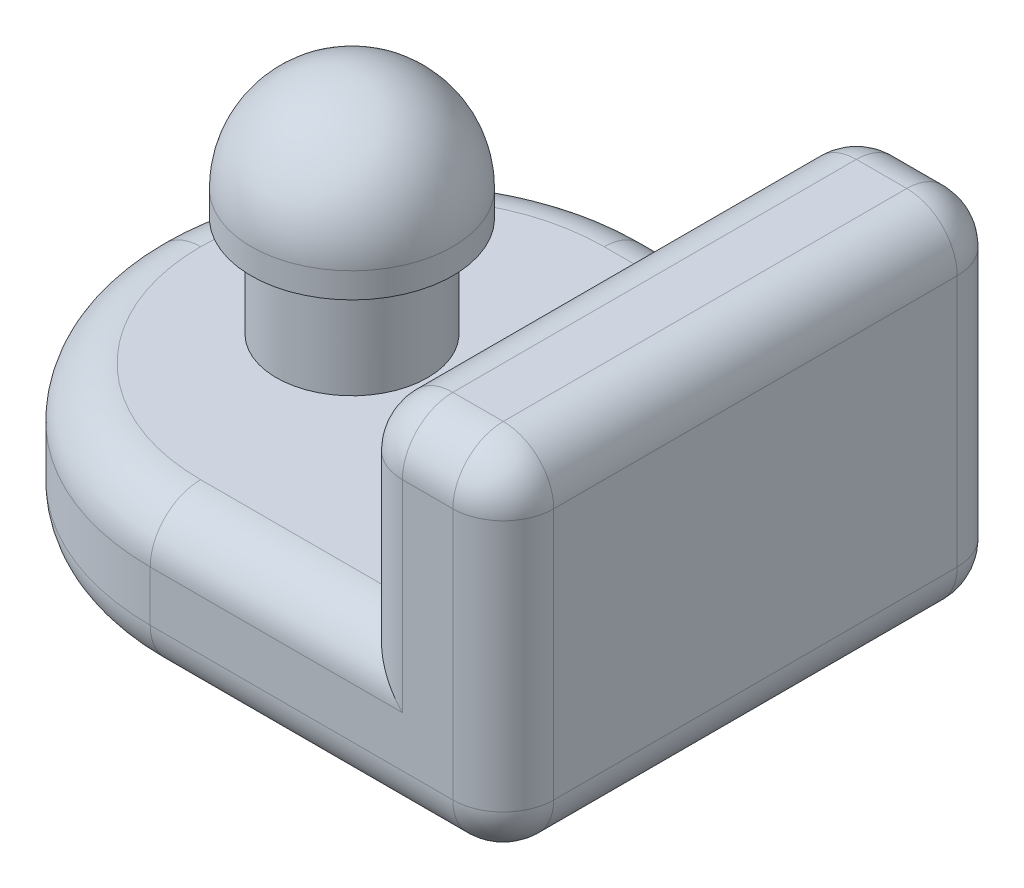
ISO-10303-21;
HEADER;
FILE_DESCRIPTION(('STEP AP214'),'2;1');
FILE_NAME('part.step','',(''),(''),'','','');
FILE_SCHEMA(('AUTOMOTIVE_DESIGN { 1 0 10303 214 1 1 1 1 }'));
ENDSEC;
DATA;
#1=APPLICATION_CONTEXT('core data for automotive mechanical design processes');
#2=APPLICATION_PROTOCOL_DEFINITION('international standard','automotive_design',2000,#1);
#3=PRODUCT_CONTEXT('',#1,'mechanical');
#4=PRODUCT('Part','Part','',(#3));
#5=PRODUCT_RELATED_PRODUCT_CATEGORY('part','',(#4));
#6=PRODUCT_DEFINITION_FORMATION('','',#4);
#7=PRODUCT_DEFINITION_CONTEXT('part definition',#1,'design');
#8=PRODUCT_DEFINITION('design','',#6,#7);
#9=PRODUCT_DEFINITION_SHAPE('','',#8);
#10=(LENGTH_UNIT() NAMED_UNIT(*) SI_UNIT(.MILLI.,.METRE.));
#11=(NAMED_UNIT(*) PLANE_ANGLE_UNIT() SI_UNIT($,.RADIAN.));
#12=(NAMED_UNIT(*) SI_UNIT($,.STERADIAN.) SOLID_ANGLE_UNIT());
#13=UNCERTAINTY_MEASURE_WITH_UNIT(LENGTH_MEASURE(1.E-05),#10,'distance_accuracy_value','');
#14=(GEOMETRIC_REPRESENTATION_CONTEXT(3) GLOBAL_UNCERTAINTY_ASSIGNED_CONTEXT((#13)) GLOBAL_UNIT_ASSIGNED_CONTEXT((#10,
#11,#12)) REPRESENTATION_CONTEXT('',''));
#15=CARTESIAN_POINT('',(0.,0.,0.));
#16=DIRECTION('',(0.,0.,1.));
#17=DIRECTION('',(1.,0.,0.));
#18=AXIS2_PLACEMENT_3D('',#15,#16,#17);
#19=CARTESIAN_POINT('',(-8.5440377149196,0.,10.));
#20=DIRECTION('',(0.,-1.,0.));
#21=DIRECTION('',(1.,0.,0.));
#22=AXIS2_PLACEMENT_3D('',#19,#20,#21);
#23=PLANE('',#22);
#24=CARTESIAN_POINT('',(-13.5440377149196,0.,5.));
#25=DIRECTION('',(0.,-1.,0.));
#26=DIRECTION('',(1.,0.,0.));
#27=AXIS2_PLACEMENT_3D('',#24,#25,#26);
#28=CIRCLE('',#27,1.5);
#29=CARTESIAN_POINT('',(-12.0440377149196,0.,5.));
#30=VERTEX_POINT('',#29);
#31=EDGE_CURVE('E282',#30,#30,#28,.F.);
#32=ORIENTED_EDGE('',*,*,#31,.F.);
#33=EDGE_LOOP('',(#32));
#34=FACE_BOUND('',#33,.T.);
#35=DIRECTION('',(0.,0.,-1.));
#36=VECTOR('',#35,1.);
#37=CARTESIAN_POINT('',(-8.5440377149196,0.,10.));
#38=LINE('',#37,#36);
#39=CARTESIAN_POINT('',(-8.5440377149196,0.,9.));
#40=VERTEX_POINT('',#39);
#41=CARTESIAN_POINT('',(-8.5440377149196,0.,0.999999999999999));
#42=VERTEX_POINT('',#41);
#43=EDGE_CURVE('E320',#40,#42,#38,.T.);
#44=ORIENTED_EDGE('',*,*,#43,.T.);
#45=DIRECTION('',(-1.,0.,0.));
#46=VECTOR('',#45,1.);
#47=CARTESIAN_POINT('',(-8.5440377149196,0.,0.999999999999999));
#48=LINE('',#47,#46);
#49=CARTESIAN_POINT('',(-12.5440377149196,0.,1.));
#50=VERTEX_POINT('',#49);
#51=EDGE_CURVE('E172',#42,#50,#48,.T.);
#52=ORIENTED_EDGE('',*,*,#51,.T.);
#53=CARTESIAN_POINT('',(-12.5440377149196,0.,5.));
#54=DIRECTION('',(0.,-1.,0.));
#55=DIRECTION('',(1.,0.,0.));
#56=AXIS2_PLACEMENT_3D('',#53,#54,#55);
#57=CIRCLE('',#56,4.);
#58=CARTESIAN_POINT('',(-16.5440377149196,0.,5.));
#59=VERTEX_POINT('',#58);
#60=EDGE_CURVE('E174',#50,#59,#57,.F.);
#61=ORIENTED_EDGE('',*,*,#60,.T.);
#62=CARTESIAN_POINT('',(-12.5440377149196,0.,5.));
#63=DIRECTION('',(0.,-1.,0.));
#64=DIRECTION('',(1.,0.,0.));
#65=AXIS2_PLACEMENT_3D('',#62,#63,#64);
#66=CIRCLE('',#65,4.);
#67=CARTESIAN_POINT('',(-12.5440377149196,0.,9.));
#68=VERTEX_POINT('',#67);
#69=EDGE_CURVE('E258',#59,#68,#66,.F.);
#70=ORIENTED_EDGE('',*,*,#69,.T.);
#71=DIRECTION('',(-1.,0.,0.));
#72=VECTOR('',#71,1.);
#73=CARTESIAN_POINT('',(-8.5440377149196,0.,9.));
#74=LINE('',#73,#72);
#75=EDGE_CURVE('E256',#68,#40,#74,.F.);
#76=ORIENTED_EDGE('',*,*,#75,.T.);
#77=EDGE_LOOP('',(#44,#52,#61,#70,#76));
#78=FACE_BOUND('',#77,.T.);
#79=ADVANCED_FACE('F32',(#34,#78),#23,.F.);
#80=CARTESIAN_POINT('',(-16.5440377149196,-3.,10.));
#81=DIRECTION('',(0.,1.,0.));
#82=DIRECTION('',(0.,0.,1.));
#83=AXIS2_PLACEMENT_3D('',#80,#81,#82);
#84=PLANE('',#83);
#85=CARTESIAN_POINT('',(-12.5440377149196,-3.,5.));
#86=DIRECTION('',(0.,1.,0.));
#87=DIRECTION('',(0.,0.,1.));
#88=AXIS2_PLACEMENT_3D('',#85,#86,#87);
#89=CIRCLE('',#88,4.);
#90=CARTESIAN_POINT('',(-16.5440377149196,-3.,5.));
#91=VERTEX_POINT('',#90);
#92=CARTESIAN_POINT('',(-12.5440377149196,-3.,1.));
#93=VERTEX_POINT('',#92);
#94=EDGE_CURVE('E41',#91,#93,#89,.F.);
#95=ORIENTED_EDGE('',*,*,#94,.T.);
#96=DIRECTION('',(1.,0.,0.));
#97=VECTOR('',#96,1.);
#98=CARTESIAN_POINT('',(-16.5440377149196,-3.,0.999999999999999));
#99=LINE('',#98,#97);
#100=CARTESIAN_POINT('',(-6.54403771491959,-3.,0.999999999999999));
#101=VERTEX_POINT('',#100);
#102=EDGE_CURVE('E12',#93,#101,#99,.T.);
#103=ORIENTED_EDGE('',*,*,#102,.T.);
#104=DIRECTION('',(0.,0.,-1.));
#105=VECTOR('',#104,1.);
#106=CARTESIAN_POINT('',(-6.54403771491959,-3.,10.));
#107=LINE('',#106,#105);
#108=CARTESIAN_POINT('',(-6.54403771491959,-3.,9.));
#109=VERTEX_POINT('',#108);
#110=EDGE_CURVE('E313',#109,#101,#107,.T.);
#111=ORIENTED_EDGE('',*,*,#110,.F.);
#112=DIRECTION('',(1.,0.,0.));
#113=VECTOR('',#112,1.);
#114=CARTESIAN_POINT('',(-12.5440377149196,-3.,9.));
#115=LINE('',#114,#113);
#116=CARTESIAN_POINT('',(-12.5440377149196,-3.,9.));
#117=VERTEX_POINT('',#116);
#118=EDGE_CURVE('E53',#109,#117,#115,.F.);
#119=ORIENTED_EDGE('',*,*,#118,.T.);
#120=CARTESIAN_POINT('',(-12.5440377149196,-3.,5.));
#121=DIRECTION('',(0.,1.,0.));
#122=DIRECTION('',(0.,0.,1.));
#123=AXIS2_PLACEMENT_3D('',#120,#121,#122);
#124=CIRCLE('',#123,4.);
#125=EDGE_CURVE('E182',#117,#91,#124,.F.);
#126=ORIENTED_EDGE('',*,*,#125,.T.);
#127=EDGE_LOOP('',(#95,#103,#111,#119,#126));
#128=FACE_BOUND('',#127,.T.);
#129=ADVANCED_FACE('F318',(#128),#84,.F.);
#130=CARTESIAN_POINT('',(-6.54403771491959,-2.,10.));
#131=DIRECTION('',(0.,0.,1.));
#132=DIRECTION('',(1.,0.,0.));
#133=AXIS2_PLACEMENT_3D('',#130,#131,#132);
#134=PLANE('',#133);
#135=DIRECTION('',(0.,-1.,0.));
#136=VECTOR('',#135,1.);
#137=CARTESIAN_POINT('',(-7.5440377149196,0.,10.));
#138=LINE('',#137,#136);
#139=CARTESIAN_POINT('',(-7.5440377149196,3.,10.));
#140=VERTEX_POINT('',#139);
#141=CARTESIAN_POINT('',(-7.5440377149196,-1.,10.));
#142=VERTEX_POINT('',#141);
#143=EDGE_CURVE('E252',#140,#142,#138,.T.);
#144=ORIENTED_EDGE('',*,*,#143,.T.);
#145=DIRECTION('',(-1.,0.,0.));
#146=VECTOR('',#145,1.);
#147=CARTESIAN_POINT('',(-12.5440377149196,-1.,10.));
#148=LINE('',#147,#146);
#149=CARTESIAN_POINT('',(-12.5440377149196,-1.,10.));
#150=VERTEX_POINT('',#149);
#151=EDGE_CURVE('E254',#142,#150,#148,.T.);
#152=ORIENTED_EDGE('',*,*,#151,.T.);
#153=DIRECTION('',(0.,-1.,0.));
#154=VECTOR('',#153,1.);
#155=CARTESIAN_POINT('',(-12.5440377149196,4.5,10.));
#156=LINE('',#155,#154);
#157=CARTESIAN_POINT('',(-12.5440377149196,-2.,10.));
#158=VERTEX_POINT('',#157);
#159=EDGE_CURVE('E167',#150,#158,#156,.T.);
#160=ORIENTED_EDGE('',*,*,#159,.T.);
#161=DIRECTION('',(1.,0.,0.));
#162=VECTOR('',#161,1.);
#163=CARTESIAN_POINT('',(-6.54403771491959,-2.,10.));
#164=LINE('',#163,#162);
#165=CARTESIAN_POINT('',(-6.54403771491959,-2.,10.));
#166=VERTEX_POINT('',#165);
#167=EDGE_CURVE('E239',#158,#166,#164,.T.);
#168=ORIENTED_EDGE('',*,*,#167,.T.);
#169=DIRECTION('',(0.,1.,0.));
#170=VECTOR('',#169,1.);
#171=CARTESIAN_POINT('',(-6.5440377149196,3.,10.));
#172=LINE('',#171,#170);
#173=CARTESIAN_POINT('',(-6.5440377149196,3.,10.));
#174=VERTEX_POINT('',#173);
#175=EDGE_CURVE('E242',#166,#174,#172,.T.);
#176=ORIENTED_EDGE('',*,*,#175,.T.);
#177=DIRECTION('',(-1.,0.,0.));
#178=VECTOR('',#177,1.);
#179=CARTESIAN_POINT('',(-7.5440377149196,3.,10.));
#180=LINE('',#179,#178);
#181=EDGE_CURVE('E245',#174,#140,#180,.T.);
#182=ORIENTED_EDGE('',*,*,#181,.T.);
#183=EDGE_LOOP('',(#144,#152,#160,#168,#176,#182));
#184=FACE_BOUND('',#183,.T.);
#185=ADVANCED_FACE('F386',(#184),#134,.T.);
#186=CARTESIAN_POINT('',(-6.54403771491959,-2.,0.));
#187=DIRECTION('',(0.,0.,1.));
#188=DIRECTION('',(1.,0.,0.));
#189=AXIS2_PLACEMENT_3D('',#186,#187,#188);
#190=PLANE('',#189);
#191=DIRECTION('',(0.,-1.,0.));
#192=VECTOR('',#191,1.);
#193=CARTESIAN_POINT('',(-12.5440377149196,4.5,0.));
#194=LINE('',#193,#192);
#195=CARTESIAN_POINT('',(-12.5440377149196,-1.,0.));
#196=VERTEX_POINT('',#195);
#197=CARTESIAN_POINT('',(-12.5440377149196,-2.,0.));
#198=VERTEX_POINT('',#197);
#199=EDGE_CURVE('E159',#196,#198,#194,.T.);
#200=ORIENTED_EDGE('',*,*,#199,.F.);
#201=DIRECTION('',(-1.,0.,0.));
#202=VECTOR('',#201,1.);
#203=CARTESIAN_POINT('',(-6.54403771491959,-1.00000000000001,0.));
#204=LINE('',#203,#202);
#205=CARTESIAN_POINT('',(-7.5440377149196,-1.00000000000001,0.));
#206=VERTEX_POINT('',#205);
#207=EDGE_CURVE('E277',#196,#206,#204,.F.);
#208=ORIENTED_EDGE('',*,*,#207,.T.);
#209=DIRECTION('',(0.,-1.,0.));
#210=VECTOR('',#209,1.);
#211=CARTESIAN_POINT('',(-7.5440377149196,-2.,0.));
#212=LINE('',#211,#210);
#213=CARTESIAN_POINT('',(-7.5440377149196,3.,0.));
#214=VERTEX_POINT('',#213);
#215=EDGE_CURVE('E288',#206,#214,#212,.F.);
#216=ORIENTED_EDGE('',*,*,#215,.T.);
#217=DIRECTION('',(-1.,0.,0.));
#218=VECTOR('',#217,1.);
#219=CARTESIAN_POINT('',(-6.54403771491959,3.,0.));
#220=LINE('',#219,#218);
#221=CARTESIAN_POINT('',(-6.5440377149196,3.,0.));
#222=VERTEX_POINT('',#221);
#223=EDGE_CURVE('E292',#214,#222,#220,.F.);
#224=ORIENTED_EDGE('',*,*,#223,.T.);
#225=DIRECTION('',(0.,1.,0.));
#226=VECTOR('',#225,1.);
#227=CARTESIAN_POINT('',(-6.54403771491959,-2.,0.));
#228=LINE('',#227,#226);
#229=CARTESIAN_POINT('',(-6.54403771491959,-2.,0.));
#230=VERTEX_POINT('',#229);
#231=EDGE_CURVE('E350',#222,#230,#228,.F.);
#232=ORIENTED_EDGE('',*,*,#231,.T.);
#233=DIRECTION('',(1.,0.,0.));
#234=VECTOR('',#233,1.);
#235=CARTESIAN_POINT('',(-6.54403771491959,-2.,0.));
#236=LINE('',#235,#234);
#237=EDGE_CURVE('E280',#230,#198,#236,.F.);
#238=ORIENTED_EDGE('',*,*,#237,.T.);
#239=EDGE_LOOP('',(#200,#208,#216,#224,#232,#238));
#240=FACE_BOUND('',#239,.T.);
#241=ADVANCED_FACE('F275',(#240),#190,.F.);
#242=CARTESIAN_POINT('',(-6.5440377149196,3.,10.));
#243=DIRECTION('',(0.,0.,-1.));
#244=DIRECTION('',(-1.,0.,0.));
#245=AXIS2_PLACEMENT_3D('',#242,#243,#244);
#246=CYLINDRICAL_SURFACE('',#245,1.);
#247=DIRECTION('',(0.,0.,-1.));
#248=VECTOR('',#247,1.);
#249=CARTESIAN_POINT('',(-5.5440377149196,3.,10.));
#250=LINE('',#249,#248);
#251=CARTESIAN_POINT('',(-5.5440377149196,3.,9.));
#252=VERTEX_POINT('',#251);
#253=CARTESIAN_POINT('',(-5.5440377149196,3.,0.999999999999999));
#254=VERTEX_POINT('',#253);
#255=EDGE_CURVE('E336',#252,#254,#250,.T.);
#256=ORIENTED_EDGE('',*,*,#255,.T.);
#257=CARTESIAN_POINT('',(-6.5440377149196,3.,0.999999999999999));
#258=DIRECTION('',(0.,0.,-1.));
#259=DIRECTION('',(-1.,0.,0.));
#260=AXIS2_PLACEMENT_3D('',#257,#258,#259);
#261=CIRCLE('',#260,1.);
#262=CARTESIAN_POINT('',(-6.5440377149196,4.,0.999999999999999));
#263=VERTEX_POINT('',#262);
#264=EDGE_CURVE('E303',#254,#263,#261,.F.);
#265=ORIENTED_EDGE('',*,*,#264,.T.);
#266=DIRECTION('',(0.,0.,-1.));
#267=VECTOR('',#266,1.);
#268=CARTESIAN_POINT('',(-6.5440377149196,4.,10.));
#269=LINE('',#268,#267);
#270=CARTESIAN_POINT('',(-6.5440377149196,4.,9.));
#271=VERTEX_POINT('',#270);
#272=EDGE_CURVE('E333',#271,#263,#269,.T.);
#273=ORIENTED_EDGE('',*,*,#272,.F.);
#274=CARTESIAN_POINT('',(-6.5440377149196,3.,9.));
#275=DIRECTION('',(0.,0.,-1.));
#276=DIRECTION('',(-1.,0.,0.));
#277=AXIS2_PLACEMENT_3D('',#274,#275,#276);
#278=CIRCLE('',#277,1.);
#279=EDGE_CURVE('E301',#271,#252,#278,.T.);
#280=ORIENTED_EDGE('',*,*,#279,.T.);
#281=EDGE_LOOP('',(#256,#265,#273,#280));
#282=FACE_BOUND('',#281,.T.);
#283=ADVANCED_FACE('F395',(#282),#246,.T.);
#284=CARTESIAN_POINT('',(-7.5440377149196,4.,10.));
#285=DIRECTION('',(0.,-1.,0.));
#286=DIRECTION('',(0.,0.,-1.));
#287=AXIS2_PLACEMENT_3D('',#284,#285,#286);
#288=PLANE('',#287);
#289=ORIENTED_EDGE('',*,*,#272,.T.);
#290=DIRECTION('',(-1.,0.,0.));
#291=VECTOR('',#290,1.);
#292=CARTESIAN_POINT('',(-7.5440377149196,4.,0.999999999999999));
#293=LINE('',#292,#291);
#294=CARTESIAN_POINT('',(-7.5440377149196,4.,0.999999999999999));
#295=VERTEX_POINT('',#294);
#296=EDGE_CURVE('E299',#263,#295,#293,.T.);
#297=ORIENTED_EDGE('',*,*,#296,.T.);
#298=DIRECTION('',(0.,0.,-1.));
#299=VECTOR('',#298,1.);
#300=CARTESIAN_POINT('',(-7.5440377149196,4.,10.));
#301=LINE('',#300,#299);
#302=CARTESIAN_POINT('',(-7.5440377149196,4.,9.));
#303=VERTEX_POINT('',#302);
#304=EDGE_CURVE('E330',#303,#295,#301,.T.);
#305=ORIENTED_EDGE('',*,*,#304,.F.);
#306=DIRECTION('',(-1.,0.,0.));
#307=VECTOR('',#306,1.);
#308=CARTESIAN_POINT('',(-6.5440377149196,4.,9.));
#309=LINE('',#308,#307);
#310=EDGE_CURVE('E297',#303,#271,#309,.F.);
#311=ORIENTED_EDGE('',*,*,#310,.T.);
#312=EDGE_LOOP('',(#289,#297,#305,#311));
#313=FACE_BOUND('',#312,.T.);
#314=ADVANCED_FACE('F369',(#313),#288,.F.);
#315=CARTESIAN_POINT('',(-7.5440377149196,3.,10.));
#316=DIRECTION('',(0.,0.,-1.));
#317=DIRECTION('',(-1.,0.,0.));
#318=AXIS2_PLACEMENT_3D('',#315,#316,#317);
#319=CYLINDRICAL_SURFACE('',#318,1.);
#320=ORIENTED_EDGE('',*,*,#304,.T.);
#321=CARTESIAN_POINT('',(-7.5440377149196,3.,0.999999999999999));
#322=DIRECTION('',(0.,0.,-1.));
#323=DIRECTION('',(-1.,0.,0.));
#324=AXIS2_PLACEMENT_3D('',#321,#322,#323);
#325=CIRCLE('',#324,1.);
#326=CARTESIAN_POINT('',(-8.5440377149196,3.,0.999999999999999));
#327=VERTEX_POINT('',#326);
#328=EDGE_CURVE('E290',#295,#327,#325,.F.);
#329=ORIENTED_EDGE('',*,*,#328,.T.);
#330=DIRECTION('',(0.,0.,-1.));
#331=VECTOR('',#330,1.);
#332=CARTESIAN_POINT('',(-8.5440377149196,3.,10.));
#333=LINE('',#332,#331);
#334=CARTESIAN_POINT('',(-8.5440377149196,3.,9.));
#335=VERTEX_POINT('',#334);
#336=EDGE_CURVE('E322',#335,#327,#333,.T.);
#337=ORIENTED_EDGE('',*,*,#336,.F.);
#338=CARTESIAN_POINT('',(-7.5440377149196,3.,9.));
#339=DIRECTION('',(0.,0.,-1.));
#340=DIRECTION('',(-1.,0.,0.));
#341=AXIS2_PLACEMENT_3D('',#338,#339,#340);
#342=CIRCLE('',#341,1.);
#343=EDGE_CURVE('E287',#335,#303,#342,.T.);
#344=ORIENTED_EDGE('',*,*,#343,.T.);
#345=EDGE_LOOP('',(#320,#329,#337,#344));
#346=FACE_BOUND('',#345,.T.);
#347=ADVANCED_FACE('F373',(#346),#319,.T.);
#348=CARTESIAN_POINT('',(-8.5440377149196,0.,10.));
#349=DIRECTION('',(1.,0.,0.));
#350=DIRECTION('',(0.,0.,-1.));
#351=AXIS2_PLACEMENT_3D('',#348,#349,#350);
#352=PLANE('',#351);
#353=ORIENTED_EDGE('',*,*,#336,.T.);
#354=DIRECTION('',(0.,-1.,0.));
#355=VECTOR('',#354,1.);
#356=CARTESIAN_POINT('',(-8.5440377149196,0.,0.999999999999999));
#357=LINE('',#356,#355);
#358=EDGE_CURVE('E346',#327,#42,#357,.T.);
#359=ORIENTED_EDGE('',*,*,#358,.T.);
#360=ORIENTED_EDGE('',*,*,#43,.F.);
#361=DIRECTION('',(0.,-1.,0.));
#362=VECTOR('',#361,1.);
#363=CARTESIAN_POINT('',(-8.5440377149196,3.,9.));
#364=LINE('',#363,#362);
#365=EDGE_CURVE('E281',#40,#335,#364,.F.);
#366=ORIENTED_EDGE('',*,*,#365,.T.);
#367=EDGE_LOOP('',(#353,#359,#360,#366));
#368=FACE_BOUND('',#367,.T.);
#369=ADVANCED_FACE('F428',(#368),#352,.F.);
#370=CARTESIAN_POINT('',(-6.54403771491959,-2.,10.));
#371=DIRECTION('',(0.,0.,-1.));
#372=DIRECTION('',(-1.,0.,0.));
#373=AXIS2_PLACEMENT_3D('',#370,#371,#372);
#374=CYLINDRICAL_SURFACE('',#373,1.);
#375=ORIENTED_EDGE('',*,*,#110,.T.);
#376=CARTESIAN_POINT('',(-6.54403771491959,-2.,0.999999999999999));
#377=DIRECTION('',(0.,0.,-1.));
#378=DIRECTION('',(-1.,0.,0.));
#379=AXIS2_PLACEMENT_3D('',#376,#377,#378);
#380=CIRCLE('',#379,1.);
#381=CARTESIAN_POINT('',(-5.54403771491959,-2.,0.999999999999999));
#382=VERTEX_POINT('',#381);
#383=EDGE_CURVE('E243',#101,#382,#380,.F.);
#384=ORIENTED_EDGE('',*,*,#383,.T.);
#385=DIRECTION('',(0.,0.,-1.));
#386=VECTOR('',#385,1.);
#387=CARTESIAN_POINT('',(-5.54403771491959,-2.,10.));
#388=LINE('',#387,#386);
#389=CARTESIAN_POINT('',(-5.54403771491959,-2.,9.));
#390=VERTEX_POINT('',#389);
#391=EDGE_CURVE('E316',#390,#382,#388,.T.);
#392=ORIENTED_EDGE('',*,*,#391,.F.);
#393=CARTESIAN_POINT('',(-6.54403771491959,-2.,9.));
#394=DIRECTION('',(0.,0.,-1.));
#395=DIRECTION('',(-1.,0.,0.));
#396=AXIS2_PLACEMENT_3D('',#393,#394,#395);
#397=CIRCLE('',#396,1.);
#398=EDGE_CURVE('E247',#390,#109,#397,.T.);
#399=ORIENTED_EDGE('',*,*,#398,.T.);
#400=EDGE_LOOP('',(#375,#384,#392,#399));
#401=FACE_BOUND('',#400,.T.);
#402=ADVANCED_FACE('F312',(#401),#374,.T.);
#403=CARTESIAN_POINT('',(-5.54403771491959,-2.,10.));
#404=DIRECTION('',(-1.,0.,0.));
#405=DIRECTION('',(0.,-1.,0.));
#406=AXIS2_PLACEMENT_3D('',#403,#404,#405);
#407=PLANE('',#406);
#408=ORIENTED_EDGE('',*,*,#391,.T.);
#409=DIRECTION('',(0.,1.,0.));
#410=VECTOR('',#409,1.);
#411=CARTESIAN_POINT('',(-5.54403771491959,-2.,0.999999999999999));
#412=LINE('',#411,#410);
#413=EDGE_CURVE('E307',#382,#254,#412,.T.);
#414=ORIENTED_EDGE('',*,*,#413,.T.);
#415=ORIENTED_EDGE('',*,*,#255,.F.);
#416=DIRECTION('',(0.,1.,0.));
#417=VECTOR('',#416,1.);
#418=CARTESIAN_POINT('',(-5.54403771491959,-2.,9.));
#419=LINE('',#418,#417);
#420=EDGE_CURVE('E305',#252,#390,#419,.F.);
#421=ORIENTED_EDGE('',*,*,#420,.T.);
#422=EDGE_LOOP('',(#408,#414,#415,#421));
#423=FACE_BOUND('',#422,.T.);
#424=ADVANCED_FACE('F403',(#423),#407,.F.);
#425=CARTESIAN_POINT('',(-13.5440377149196,2.,5.));
#426=DIRECTION('',(0.,-1.,0.));
#427=DIRECTION('',(1.,0.,0.));
#428=AXIS2_PLACEMENT_3D('',#425,#426,#427);
#429=CYLINDRICAL_SURFACE('',#428,1.5);
#430=CARTESIAN_POINT('',(-13.5440377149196,2.,5.));
#431=DIRECTION('',(0.,1.,0.));
#432=DIRECTION('',(-1.,0.,0.));
#433=AXIS2_PLACEMENT_3D('',#430,#431,#432);
#434=CIRCLE('',#433,1.5);
#435=CARTESIAN_POINT('',(-15.0440377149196,2.,5.));
#436=VERTEX_POINT('',#435);
#437=EDGE_CURVE('E324',#436,#436,#434,.T.);
#438=ORIENTED_EDGE('',*,*,#437,.F.);
#439=EDGE_LOOP('',(#438));
#440=FACE_BOUND('',#439,.T.);
#441=ORIENTED_EDGE('',*,*,#31,.T.);
#442=EDGE_LOOP('',(#441));
#443=FACE_BOUND('',#442,.T.);
#444=ADVANCED_FACE('F646',(#440,#443),#429,.T.);
#445=CARTESIAN_POINT('',(-13.5440377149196,2.,5.));
#446=DIRECTION('',(0.,1.,0.));
#447=DIRECTION('',(-1.,0.,0.));
#448=AXIS2_PLACEMENT_3D('',#445,#446,#447);
#449=PLANE('',#448);
#450=CARTESIAN_POINT('',(-13.5440377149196,2.,5.));
#451=DIRECTION('',(0.,1.,0.));
#452=DIRECTION('',(-1.,0.,0.));
#453=AXIS2_PLACEMENT_3D('',#450,#451,#452);
#454=CIRCLE('',#453,2.);
#455=CARTESIAN_POINT('',(-15.5440377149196,2.,5.));
#456=VERTEX_POINT('',#455);
#457=EDGE_CURVE('E343',#456,#456,#454,.T.);
#458=ORIENTED_EDGE('',*,*,#457,.F.);
#459=EDGE_LOOP('',(#458));
#460=FACE_BOUND('',#459,.T.);
#461=ORIENTED_EDGE('',*,*,#437,.T.);
#462=EDGE_LOOP('',(#461));
#463=FACE_BOUND('',#462,.T.);
#464=ADVANCED_FACE('F637',(#460,#463),#449,.F.);
#465=CARTESIAN_POINT('',(-13.5440377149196,2.5,5.));
#466=DIRECTION('',(0.,-1.,0.));
#467=DIRECTION('',(1.,0.,0.));
#468=AXIS2_PLACEMENT_3D('',#465,#466,#467);
#469=CYLINDRICAL_SURFACE('',#468,2.);
#470=CARTESIAN_POINT('',(-13.5440377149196,2.5,5.));
#471=DIRECTION('',(0.,1.,0.));
#472=DIRECTION('',(-1.,0.,0.));
#473=AXIS2_PLACEMENT_3D('',#470,#471,#472);
#474=CIRCLE('',#473,2.);
#475=CARTESIAN_POINT('',(-15.5440377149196,2.5,5.));
#476=VERTEX_POINT('',#475);
#477=EDGE_CURVE('E341',#476,#476,#474,.T.);
#478=ORIENTED_EDGE('',*,*,#477,.F.);
#479=EDGE_LOOP('',(#478));
#480=FACE_BOUND('',#479,.T.);
#481=ORIENTED_EDGE('',*,*,#457,.T.);
#482=EDGE_LOOP('',(#481));
#483=FACE_BOUND('',#482,.T.);
#484=ADVANCED_FACE('F441',(#480,#483),#469,.T.);
#485=CARTESIAN_POINT('',(-13.5440377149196,2.5,5.));
#486=DIRECTION('',(0.,0.,1.));
#487=DIRECTION('',(1.,0.,0.));
#488=AXIS2_PLACEMENT_3D('',#485,#486,#487);
#489=SPHERICAL_SURFACE('',#488,2.);
#490=CARTESIAN_POINT('',(-13.5440377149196,2.5,5.));
#491=DIRECTION('',(0.,1.,0.));
#492=DIRECTION('',(-1.,0.,0.));
#493=AXIS2_PLACEMENT_3D('',#490,#491,#492);
#494=SPHERICAL_SURFACE('',#493,2.);
#495=ORIENTED_EDGE('',*,*,#477,.T.);
#496=EDGE_LOOP('',(#495));
#497=FACE_BOUND('',#496,.T.);
#498=ADVANCED_FACE('F438',(#497),#494,.T.);
#499=CARTESIAN_POINT('',(-12.5440377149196,4.5,5.));
#500=DIRECTION('',(0.,-1.,0.));
#501=DIRECTION('',(0.,0.,-1.));
#502=AXIS2_PLACEMENT_3D('',#499,#500,#501);
#503=CYLINDRICAL_SURFACE('',#502,5.);
#504=CARTESIAN_POINT('',(-12.5440377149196,-1.,5.));
#505=DIRECTION('',(0.,-1.,0.));
#506=DIRECTION('',(1.,0.,0.));
#507=AXIS2_PLACEMENT_3D('',#504,#505,#506);
#508=CIRCLE('',#507,5.);
#509=CARTESIAN_POINT('',(-17.5440377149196,-1.00000000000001,5.));
#510=VERTEX_POINT('',#509);
#511=EDGE_CURVE('E162',#150,#510,#508,.T.);
#512=ORIENTED_EDGE('',*,*,#511,.T.);
#513=CARTESIAN_POINT('',(-12.5440377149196,-1.,5.));
#514=DIRECTION('',(0.,-1.,0.));
#515=DIRECTION('',(1.,0.,0.));
#516=AXIS2_PLACEMENT_3D('',#513,#514,#515);
#517=CIRCLE('',#516,5.);
#518=EDGE_CURVE('E179',#510,#196,#517,.T.);
#519=ORIENTED_EDGE('',*,*,#518,.T.);
#520=ORIENTED_EDGE('',*,*,#199,.T.);
#521=CARTESIAN_POINT('',(-12.5440377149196,-2.,5.));
#522=DIRECTION('',(0.,1.,0.));
#523=DIRECTION('',(0.,0.,1.));
#524=AXIS2_PLACEMENT_3D('',#521,#522,#523);
#525=CIRCLE('',#524,5.);
#526=CARTESIAN_POINT('',(-17.5440377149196,-2.,5.));
#527=VERTEX_POINT('',#526);
#528=EDGE_CURVE('E151',#198,#527,#525,.T.);
#529=ORIENTED_EDGE('',*,*,#528,.T.);
#530=CARTESIAN_POINT('',(-12.5440377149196,-2.,5.));
#531=DIRECTION('',(0.,1.,0.));
#532=DIRECTION('',(0.,0.,1.));
#533=AXIS2_PLACEMENT_3D('',#530,#531,#532);
#534=CIRCLE('',#533,5.);
#535=EDGE_CURVE('E156',#527,#158,#534,.T.);
#536=ORIENTED_EDGE('',*,*,#535,.T.);
#537=ORIENTED_EDGE('',*,*,#159,.F.);
#538=EDGE_LOOP('',(#512,#519,#520,#529,#536,#537));
#539=FACE_BOUND('',#538,.T.);
#540=ADVANCED_FACE('F153',(#539),#503,.T.);
#541=CARTESIAN_POINT('',(-12.5440377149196,-2.,5.));
#542=DIRECTION('',(0.,1.,0.));
#543=DIRECTION('',(0.,0.,1.));
#544=AXIS2_PLACEMENT_3D('',#541,#542,#543);
#545=TOROIDAL_SURFACE('',#544,4.,1.);
#546=CARTESIAN_POINT('',(-16.5440377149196,-2.,5.));
#547=DIRECTION('',(0.,0.,1.));
#548=DIRECTION('',(1.,0.,0.));
#549=AXIS2_PLACEMENT_3D('',#546,#547,#548);
#550=CIRCLE('',#549,1.);
#551=EDGE_CURVE('E36',#527,#91,#550,.T.);
#552=ORIENTED_EDGE('',*,*,#551,.T.);
#553=ORIENTED_EDGE('',*,*,#125,.F.);
#554=CARTESIAN_POINT('',(-12.5440377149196,-2.,9.));
#555=DIRECTION('',(1.,0.,0.));
#556=DIRECTION('',(0.,0.,-1.));
#557=AXIS2_PLACEMENT_3D('',#554,#555,#556);
#558=CIRCLE('',#557,1.);
#559=EDGE_CURVE('E168',#158,#117,#558,.T.);
#560=ORIENTED_EDGE('',*,*,#559,.F.);
#561=ORIENTED_EDGE('',*,*,#535,.F.);
#562=EDGE_LOOP('',(#552,#553,#560,#561));
#563=FACE_BOUND('',#562,.T.);
#564=ADVANCED_FACE('F34',(#563),#545,.T.);
#565=CARTESIAN_POINT('',(-6.54403771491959,-2.,9.));
#566=DIRECTION('',(-1.,0.,0.));
#567=DIRECTION('',(0.,0.,1.));
#568=AXIS2_PLACEMENT_3D('',#565,#566,#567);
#569=CYLINDRICAL_SURFACE('',#568,1.);
#570=ORIENTED_EDGE('',*,*,#559,.T.);
#571=ORIENTED_EDGE('',*,*,#118,.F.);
#572=CARTESIAN_POINT('',(-6.54403771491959,-2.,9.));
#573=DIRECTION('',(1.,0.,0.));
#574=DIRECTION('',(0.,1.,0.));
#575=AXIS2_PLACEMENT_3D('',#572,#573,#574);
#576=CIRCLE('',#575,1.);
#577=EDGE_CURVE('E234',#166,#109,#576,.T.);
#578=ORIENTED_EDGE('',*,*,#577,.F.);
#579=ORIENTED_EDGE('',*,*,#167,.F.);
#580=EDGE_LOOP('',(#570,#571,#578,#579));
#581=FACE_BOUND('',#580,.T.);
#582=ADVANCED_FACE('F237',(#581),#569,.T.);
#583=CARTESIAN_POINT('',(-12.5440377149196,-2.,5.));
#584=DIRECTION('',(0.,1.,0.));
#585=DIRECTION('',(0.,0.,1.));
#586=AXIS2_PLACEMENT_3D('',#583,#584,#585);
#587=TOROIDAL_SURFACE('',#586,4.,1.);
#588=ORIENTED_EDGE('',*,*,#551,.F.);
#589=ORIENTED_EDGE('',*,*,#528,.F.);
#590=CARTESIAN_POINT('',(-12.5440377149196,-2.,1.));
#591=DIRECTION('',(1.,0.,0.));
#592=DIRECTION('',(0.,0.,-1.));
#593=AXIS2_PLACEMENT_3D('',#590,#591,#592);
#594=CIRCLE('',#593,1.);
#595=EDGE_CURVE('E232',#93,#198,#594,.T.);
#596=ORIENTED_EDGE('',*,*,#595,.F.);
#597=ORIENTED_EDGE('',*,*,#94,.F.);
#598=EDGE_LOOP('',(#588,#589,#596,#597));
#599=FACE_BOUND('',#598,.T.);
#600=ADVANCED_FACE('F165',(#599),#587,.T.);
#601=CARTESIAN_POINT('',(-6.54403771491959,-2.,9.));
#602=DIRECTION('',(0.,0.,1.));
#603=DIRECTION('',(1.,0.,0.));
#604=AXIS2_PLACEMENT_3D('',#601,#602,#603);
#605=SPHERICAL_SURFACE('',#604,1.);
#606=ORIENTED_EDGE('',*,*,#577,.T.);
#607=ORIENTED_EDGE('',*,*,#398,.F.);
#608=CARTESIAN_POINT('',(-6.54403771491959,-2.,9.));
#609=DIRECTION('',(0.,1.,0.));
#610=DIRECTION('',(0.,0.,1.));
#611=AXIS2_PLACEMENT_3D('',#608,#609,#610);
#612=CIRCLE('',#611,1.);
#613=EDGE_CURVE('E229',#166,#390,#612,.T.);
#614=ORIENTED_EDGE('',*,*,#613,.F.);
#615=EDGE_LOOP('',(#606,#607,#614));
#616=FACE_BOUND('',#615,.T.);
#617=ADVANCED_FACE('F410',(#616),#605,.T.);
#618=CARTESIAN_POINT('',(-16.5440377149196,-2.,0.999999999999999));
#619=DIRECTION('',(1.,0.,0.));
#620=DIRECTION('',(0.,0.,-1.));
#621=AXIS2_PLACEMENT_3D('',#618,#619,#620);
#622=CYLINDRICAL_SURFACE('',#621,1.);
#623=ORIENTED_EDGE('',*,*,#595,.T.);
#624=ORIENTED_EDGE('',*,*,#237,.F.);
#625=CARTESIAN_POINT('',(-6.54403771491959,-2.,0.999999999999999));
#626=DIRECTION('',(1.,0.,0.));
#627=DIRECTION('',(0.,0.,-1.));
#628=AXIS2_PLACEMENT_3D('',#625,#626,#627);
#629=CIRCLE('',#628,1.);
#630=EDGE_CURVE('E226',#101,#230,#629,.T.);
#631=ORIENTED_EDGE('',*,*,#630,.F.);
#632=ORIENTED_EDGE('',*,*,#102,.F.);
#633=EDGE_LOOP('',(#623,#624,#631,#632));
#634=FACE_BOUND('',#633,.T.);
#635=ADVANCED_FACE('F408',(#634),#622,.T.);
#636=CARTESIAN_POINT('',(-6.54403771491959,-2.,9.));
#637=DIRECTION('',(0.,-1.,0.));
#638=DIRECTION('',(1.,0.,0.));
#639=AXIS2_PLACEMENT_3D('',#636,#637,#638);
#640=CYLINDRICAL_SURFACE('',#639,1.);
#641=ORIENTED_EDGE('',*,*,#613,.T.);
#642=ORIENTED_EDGE('',*,*,#420,.F.);
#643=CARTESIAN_POINT('',(-6.5440377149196,3.,9.));
#644=DIRECTION('',(0.,1.,0.));
#645=DIRECTION('',(-1.,0.,0.));
#646=AXIS2_PLACEMENT_3D('',#643,#644,#645);
#647=CIRCLE('',#646,1.);
#648=EDGE_CURVE('E223',#174,#252,#647,.T.);
#649=ORIENTED_EDGE('',*,*,#648,.F.);
#650=ORIENTED_EDGE('',*,*,#175,.F.);
#651=EDGE_LOOP('',(#641,#642,#649,#650));
#652=FACE_BOUND('',#651,.T.);
#653=ADVANCED_FACE('F401',(#652),#640,.T.);
#654=CARTESIAN_POINT('',(-6.54403771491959,-2.,0.999999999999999));
#655=DIRECTION('',(0.,0.,1.));
#656=DIRECTION('',(1.,0.,0.));
#657=AXIS2_PLACEMENT_3D('',#654,#655,#656);
#658=SPHERICAL_SURFACE('',#657,1.);
#659=ORIENTED_EDGE('',*,*,#383,.F.);
#660=ORIENTED_EDGE('',*,*,#630,.T.);
#661=CARTESIAN_POINT('',(-6.54403771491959,-2.,0.999999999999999));
#662=DIRECTION('',(0.,1.,0.));
#663=DIRECTION('',(0.,0.,1.));
#664=AXIS2_PLACEMENT_3D('',#661,#662,#663);
#665=CIRCLE('',#664,1.);
#666=EDGE_CURVE('E220',#382,#230,#665,.T.);
#667=ORIENTED_EDGE('',*,*,#666,.F.);
#668=EDGE_LOOP('',(#659,#660,#667));
#669=FACE_BOUND('',#668,.T.);
#670=ADVANCED_FACE('F406',(#669),#658,.T.);
#671=CARTESIAN_POINT('',(-6.5440377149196,3.,9.));
#672=DIRECTION('',(0.,0.,1.));
#673=DIRECTION('',(1.,0.,0.));
#674=AXIS2_PLACEMENT_3D('',#671,#672,#673);
#675=SPHERICAL_SURFACE('',#674,1.);
#676=ORIENTED_EDGE('',*,*,#648,.T.);
#677=ORIENTED_EDGE('',*,*,#279,.F.);
#678=CARTESIAN_POINT('',(-6.5440377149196,3.,9.));
#679=DIRECTION('',(-1.,0.,0.));
#680=DIRECTION('',(0.,0.,1.));
#681=AXIS2_PLACEMENT_3D('',#678,#679,#680);
#682=CIRCLE('',#681,1.);
#683=EDGE_CURVE('E217',#174,#271,#682,.T.);
#684=ORIENTED_EDGE('',*,*,#683,.F.);
#685=EDGE_LOOP('',(#676,#677,#684));
#686=FACE_BOUND('',#685,.T.);
#687=ADVANCED_FACE('F398',(#686),#675,.T.);
#688=CARTESIAN_POINT('',(-6.54403771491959,-2.,0.999999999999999));
#689=DIRECTION('',(0.,1.,0.));
#690=DIRECTION('',(-1.,0.,0.));
#691=AXIS2_PLACEMENT_3D('',#688,#689,#690);
#692=CYLINDRICAL_SURFACE('',#691,1.);
#693=ORIENTED_EDGE('',*,*,#666,.T.);
#694=ORIENTED_EDGE('',*,*,#231,.F.);
#695=CARTESIAN_POINT('',(-6.5440377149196,3.,0.999999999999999));
#696=DIRECTION('',(0.,1.,0.));
#697=DIRECTION('',(-1.,0.,0.));
#698=AXIS2_PLACEMENT_3D('',#695,#696,#697);
#699=CIRCLE('',#698,1.);
#700=EDGE_CURVE('E214',#254,#222,#699,.T.);
#701=ORIENTED_EDGE('',*,*,#700,.F.);
#702=ORIENTED_EDGE('',*,*,#413,.F.);
#703=EDGE_LOOP('',(#693,#694,#701,#702));
#704=FACE_BOUND('',#703,.T.);
#705=ADVANCED_FACE('F357',(#704),#692,.T.);
#706=CARTESIAN_POINT('',(-6.54403771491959,3.,9.));
#707=DIRECTION('',(1.,0.,0.));
#708=DIRECTION('',(0.,0.,-1.));
#709=AXIS2_PLACEMENT_3D('',#706,#707,#708);
#710=CYLINDRICAL_SURFACE('',#709,1.);
#711=ORIENTED_EDGE('',*,*,#683,.T.);
#712=ORIENTED_EDGE('',*,*,#310,.F.);
#713=CARTESIAN_POINT('',(-7.5440377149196,3.,9.));
#714=DIRECTION('',(-1.,0.,0.));
#715=DIRECTION('',(0.,0.,1.));
#716=AXIS2_PLACEMENT_3D('',#713,#714,#715);
#717=CIRCLE('',#716,1.);
#718=EDGE_CURVE('E211',#140,#303,#717,.T.);
#719=ORIENTED_EDGE('',*,*,#718,.F.);
#720=ORIENTED_EDGE('',*,*,#181,.F.);
#721=EDGE_LOOP('',(#711,#712,#719,#720));
#722=FACE_BOUND('',#721,.T.);
#723=ADVANCED_FACE('F391',(#722),#710,.T.);
#724=CARTESIAN_POINT('',(-6.5440377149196,3.,0.999999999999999));
#725=DIRECTION('',(0.,0.,1.));
#726=DIRECTION('',(1.,0.,0.));
#727=AXIS2_PLACEMENT_3D('',#724,#725,#726);
#728=SPHERICAL_SURFACE('',#727,1.);
#729=ORIENTED_EDGE('',*,*,#264,.F.);
#730=ORIENTED_EDGE('',*,*,#700,.T.);
#731=CARTESIAN_POINT('',(-6.5440377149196,3.,0.999999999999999));
#732=DIRECTION('',(-1.,0.,0.));
#733=DIRECTION('',(0.,0.,1.));
#734=AXIS2_PLACEMENT_3D('',#731,#732,#733);
#735=CIRCLE('',#734,1.);
#736=EDGE_CURVE('E208',#263,#222,#735,.T.);
#737=ORIENTED_EDGE('',*,*,#736,.F.);
#738=EDGE_LOOP('',(#729,#730,#737));
#739=FACE_BOUND('',#738,.T.);
#740=ADVANCED_FACE('F363',(#739),#728,.T.);
#741=CARTESIAN_POINT('',(-7.5440377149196,3.,9.));
#742=DIRECTION('',(0.,0.,1.));
#743=DIRECTION('',(1.,0.,0.));
#744=AXIS2_PLACEMENT_3D('',#741,#742,#743);
#745=SPHERICAL_SURFACE('',#744,1.);
#746=ORIENTED_EDGE('',*,*,#718,.T.);
#747=ORIENTED_EDGE('',*,*,#343,.F.);
#748=CARTESIAN_POINT('',(-7.5440377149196,3.,9.));
#749=DIRECTION('',(0.,-1.,0.));
#750=DIRECTION('',(0.,0.,-1.));
#751=AXIS2_PLACEMENT_3D('',#748,#749,#750);
#752=CIRCLE('',#751,1.);
#753=EDGE_CURVE('E205',#140,#335,#752,.T.);
#754=ORIENTED_EDGE('',*,*,#753,.F.);
#755=EDGE_LOOP('',(#746,#747,#754));
#756=FACE_BOUND('',#755,.T.);
#757=ADVANCED_FACE('F378',(#756),#745,.T.);
#758=CARTESIAN_POINT('',(-7.5440377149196,3.,0.999999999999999));
#759=DIRECTION('',(-1.,0.,0.));
#760=DIRECTION('',(0.,0.,1.));
#761=AXIS2_PLACEMENT_3D('',#758,#759,#760);
#762=CYLINDRICAL_SURFACE('',#761,1.);
#763=ORIENTED_EDGE('',*,*,#736,.T.);
#764=ORIENTED_EDGE('',*,*,#223,.F.);
#765=CARTESIAN_POINT('',(-7.5440377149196,3.,0.999999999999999));
#766=DIRECTION('',(-1.,0.,0.));
#767=DIRECTION('',(0.,0.,1.));
#768=AXIS2_PLACEMENT_3D('',#765,#766,#767);
#769=CIRCLE('',#768,1.);
#770=EDGE_CURVE('E202',#295,#214,#769,.T.);
#771=ORIENTED_EDGE('',*,*,#770,.F.);
#772=ORIENTED_EDGE('',*,*,#296,.F.);
#773=EDGE_LOOP('',(#763,#764,#771,#772));
#774=FACE_BOUND('',#773,.T.);
#775=ADVANCED_FACE('F365',(#774),#762,.T.);
#776=CARTESIAN_POINT('',(-7.5440377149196,-2.,9.));
#777=DIRECTION('',(0.,1.,0.));
#778=DIRECTION('',(0.,0.,1.));
#779=AXIS2_PLACEMENT_3D('',#776,#777,#778);
#780=CYLINDRICAL_SURFACE('',#779,1.);
#781=ORIENTED_EDGE('',*,*,#753,.T.);
#782=ORIENTED_EDGE('',*,*,#365,.F.);
#783=CARTESIAN_POINT('',(-7.5440377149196,-1.,9.));
#784=DIRECTION('',(0.707106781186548,0.707106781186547,0.));
#785=DIRECTION('',(-0.707106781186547,0.707106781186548,0.));
#786=AXIS2_PLACEMENT_3D('',#783,#784,#785);
#787=ELLIPSE('',#786,1.4142135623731,1.);
#788=EDGE_CURVE('E199',#142,#40,#787,.F.);
#789=ORIENTED_EDGE('',*,*,#788,.F.);
#790=ORIENTED_EDGE('',*,*,#143,.F.);
#791=EDGE_LOOP('',(#781,#782,#789,#790));
#792=FACE_BOUND('',#791,.T.);
#793=ADVANCED_FACE('F383',(#792),#780,.T.);
#794=CARTESIAN_POINT('',(-7.5440377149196,3.,0.999999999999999));
#795=DIRECTION('',(0.,0.,1.));
#796=DIRECTION('',(1.,0.,0.));
#797=AXIS2_PLACEMENT_3D('',#794,#795,#796);
#798=SPHERICAL_SURFACE('',#797,1.);
#799=ORIENTED_EDGE('',*,*,#328,.F.);
#800=ORIENTED_EDGE('',*,*,#770,.T.);
#801=CARTESIAN_POINT('',(-7.5440377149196,3.,0.999999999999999));
#802=DIRECTION('',(0.,-1.,0.));
#803=DIRECTION('',(0.,0.,-1.));
#804=AXIS2_PLACEMENT_3D('',#801,#802,#803);
#805=CIRCLE('',#804,1.);
#806=EDGE_CURVE('E197',#327,#214,#805,.T.);
#807=ORIENTED_EDGE('',*,*,#806,.F.);
#808=EDGE_LOOP('',(#799,#800,#807));
#809=FACE_BOUND('',#808,.T.);
#810=ADVANCED_FACE('F456',(#809),#798,.T.);
#811=CARTESIAN_POINT('',(-6.54403771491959,-1.00000000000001,9.));
#812=DIRECTION('',(1.,0.,0.));
#813=DIRECTION('',(0.,1.,0.));
#814=AXIS2_PLACEMENT_3D('',#811,#812,#813);
#815=CYLINDRICAL_SURFACE('',#814,1.);
#816=ORIENTED_EDGE('',*,*,#788,.T.);
#817=ORIENTED_EDGE('',*,*,#75,.F.);
#818=CARTESIAN_POINT('',(-12.5440377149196,-1.,9.));
#819=DIRECTION('',(-1.,0.,0.));
#820=DIRECTION('',(0.,0.,1.));
#821=AXIS2_PLACEMENT_3D('',#818,#819,#820);
#822=CIRCLE('',#821,1.);
#823=EDGE_CURVE('E194',#150,#68,#822,.T.);
#824=ORIENTED_EDGE('',*,*,#823,.F.);
#825=ORIENTED_EDGE('',*,*,#151,.F.);
#826=EDGE_LOOP('',(#816,#817,#824,#825));
#827=FACE_BOUND('',#826,.T.);
#828=ADVANCED_FACE('F452',(#827),#815,.T.);
#829=CARTESIAN_POINT('',(-7.5440377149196,0.,0.999999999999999));
#830=DIRECTION('',(0.,-1.,0.));
#831=DIRECTION('',(0.,0.,-1.));
#832=AXIS2_PLACEMENT_3D('',#829,#830,#831);
#833=CYLINDRICAL_SURFACE('',#832,1.);
#834=ORIENTED_EDGE('',*,*,#806,.T.);
#835=ORIENTED_EDGE('',*,*,#215,.F.);
#836=CARTESIAN_POINT('',(-7.5440377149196,-1.00000000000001,0.999999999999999));
#837=DIRECTION('',(-0.707106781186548,-0.707106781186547,0.));
#838=DIRECTION('',(0.707106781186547,-0.707106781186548,0.));
#839=AXIS2_PLACEMENT_3D('',#836,#837,#838);
#840=ELLIPSE('',#839,1.4142135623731,1.);
#841=EDGE_CURVE('E191',#42,#206,#840,.T.);
#842=ORIENTED_EDGE('',*,*,#841,.F.);
#843=ORIENTED_EDGE('',*,*,#358,.F.);
#844=EDGE_LOOP('',(#834,#835,#842,#843));
#845=FACE_BOUND('',#844,.T.);
#846=ADVANCED_FACE('F449',(#845),#833,.T.);
#847=CARTESIAN_POINT('',(-12.5440377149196,-1.,5.));
#848=DIRECTION('',(0.,-1.,0.));
#849=DIRECTION('',(1.,0.,0.));
#850=AXIS2_PLACEMENT_3D('',#847,#848,#849);
#851=TOROIDAL_SURFACE('',#850,4.,1.);
#852=ORIENTED_EDGE('',*,*,#823,.T.);
#853=ORIENTED_EDGE('',*,*,#69,.F.);
#854=CARTESIAN_POINT('',(-16.5440377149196,-0.999999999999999,5.));
#855=DIRECTION('',(0.,0.,-1.));
#856=DIRECTION('',(-1.,0.,0.));
#857=AXIS2_PLACEMENT_3D('',#854,#855,#856);
#858=CIRCLE('',#857,1.);
#859=EDGE_CURVE('E188',#510,#59,#858,.T.);
#860=ORIENTED_EDGE('',*,*,#859,.F.);
#861=ORIENTED_EDGE('',*,*,#511,.F.);
#862=EDGE_LOOP('',(#852,#853,#860,#861));
#863=FACE_BOUND('',#862,.T.);
#864=ADVANCED_FACE('F268',(#863),#851,.T.);
#865=CARTESIAN_POINT('',(-8.5440377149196,-1.,0.999999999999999));
#866=DIRECTION('',(-1.,0.,0.));
#867=DIRECTION('',(0.,-1.,0.));
#868=AXIS2_PLACEMENT_3D('',#865,#866,#867);
#869=CYLINDRICAL_SURFACE('',#868,1.);
#870=ORIENTED_EDGE('',*,*,#841,.T.);
#871=ORIENTED_EDGE('',*,*,#207,.F.);
#872=CARTESIAN_POINT('',(-12.5440377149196,-1.,0.999999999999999));
#873=DIRECTION('',(-1.,0.,0.));
#874=DIRECTION('',(0.,0.,1.));
#875=AXIS2_PLACEMENT_3D('',#872,#873,#874);
#876=CIRCLE('',#875,1.);
#877=EDGE_CURVE('E185',#50,#196,#876,.T.);
#878=ORIENTED_EDGE('',*,*,#877,.F.);
#879=ORIENTED_EDGE('',*,*,#51,.F.);
#880=EDGE_LOOP('',(#870,#871,#878,#879));
#881=FACE_BOUND('',#880,.T.);
#882=ADVANCED_FACE('F285',(#881),#869,.T.);
#883=CARTESIAN_POINT('',(-12.5440377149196,-1.,5.));
#884=DIRECTION('',(0.,-1.,0.));
#885=DIRECTION('',(1.,0.,0.));
#886=AXIS2_PLACEMENT_3D('',#883,#884,#885);
#887=TOROIDAL_SURFACE('',#886,4.,1.);
#888=ORIENTED_EDGE('',*,*,#877,.T.);
#889=ORIENTED_EDGE('',*,*,#518,.F.);
#890=ORIENTED_EDGE('',*,*,#859,.T.);
#891=ORIENTED_EDGE('',*,*,#60,.F.);
#892=EDGE_LOOP('',(#888,#889,#890,#891));
#893=FACE_BOUND('',#892,.T.);
#894=ADVANCED_FACE('F272',(#893),#887,.T.);
#895=CLOSED_SHELL('',(#79,#129,#185,#241,#283,#314,#347,#369,#402,#424,#444,#464,#484,#498,#540,
#564,#582,#600,#617,#635,#653,#670,#687,#705,#723,#740,#757,#775,#793,#810,#828,#846,#864,#882,#894));
#896=MANIFOLD_SOLID_BREP('B2',#895);
#897=ADVANCED_BREP_SHAPE_REPRESENTATION('',(#18,#896),#14);
#898=SHAPE_DEFINITION_REPRESENTATION(#9,#897);
ENDSEC;
END-ISO-10303-21;
